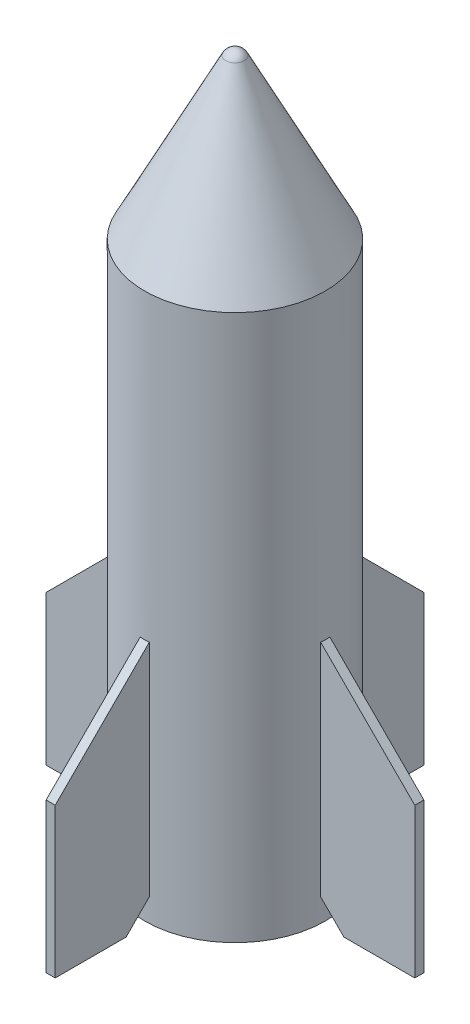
ISO-10303-21;
HEADER;
FILE_DESCRIPTION(('STEP AP214'),'2;1');
FILE_NAME('part.step','',(''),(''),'','','');
FILE_SCHEMA(('AUTOMOTIVE_DESIGN { 1 0 10303 214 1 1 1 1 }'));
ENDSEC;
DATA;
#1=APPLICATION_CONTEXT('core data for automotive mechanical design processes');
#2=APPLICATION_PROTOCOL_DEFINITION('international standard','automotive_design',2000,#1);
#3=PRODUCT_CONTEXT('',#1,'mechanical');
#4=PRODUCT('Part','Part','',(#3));
#5=PRODUCT_RELATED_PRODUCT_CATEGORY('part','',(#4));
#6=PRODUCT_DEFINITION_FORMATION('','',#4);
#7=PRODUCT_DEFINITION_CONTEXT('part definition',#1,'design');
#8=PRODUCT_DEFINITION('design','',#6,#7);
#9=PRODUCT_DEFINITION_SHAPE('','',#8);
#10=(LENGTH_UNIT() NAMED_UNIT(*) SI_UNIT(.MILLI.,.METRE.));
#11=(NAMED_UNIT(*) PLANE_ANGLE_UNIT() SI_UNIT($,.RADIAN.));
#12=(NAMED_UNIT(*) SI_UNIT($,.STERADIAN.) SOLID_ANGLE_UNIT());
#13=UNCERTAINTY_MEASURE_WITH_UNIT(LENGTH_MEASURE(1.E-05),#10,'distance_accuracy_value','');
#14=(GEOMETRIC_REPRESENTATION_CONTEXT(3) GLOBAL_UNCERTAINTY_ASSIGNED_CONTEXT((#13)) GLOBAL_UNIT_ASSIGNED_CONTEXT((#10,
#11,#12)) REPRESENTATION_CONTEXT('',''));
#15=CARTESIAN_POINT('',(0.,0.,0.));
#16=DIRECTION('',(0.,0.,1.));
#17=DIRECTION('',(1.,0.,0.));
#18=AXIS2_PLACEMENT_3D('',#15,#16,#17);
#19=CARTESIAN_POINT('',(0.,300.,0.));
#20=DIRECTION('',(0.,-1.,0.));
#21=DIRECTION('',(0.,0.,-1.));
#22=AXIS2_PLACEMENT_3D('',#19,#20,#21);
#23=CYLINDRICAL_SURFACE('',#22,49.673);
#24=CARTESIAN_POINT('',(0.,183.613789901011,0.));
#25=DIRECTION('',(0.,-0.707106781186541,0.707106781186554));
#26=DIRECTION('',(0.,-0.707106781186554,-0.707106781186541));
#27=AXIS2_PLACEMENT_3D('',#24,#25,#26);
#28=ELLIPSE('',#27,70.2482302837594,49.673);
#29=CARTESIAN_POINT('',(-2.50000000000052,134.003741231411,-49.6100486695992));
#30=VERTEX_POINT('',#29);
#31=CARTESIAN_POINT('',(2.49999999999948,134.003741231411,-49.6100486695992));
#32=VERTEX_POINT('',#31);
#33=EDGE_CURVE('E40',#30,#32,#28,.T.);
#34=ORIENTED_EDGE('',*,*,#33,.F.);
#35=DIRECTION('',(0.,-1.,0.));
#36=VECTOR('',#35,1.);
#37=CARTESIAN_POINT('',(-2.50000000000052,300.,-49.6100486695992));
#38=LINE('',#37,#36);
#39=CARTESIAN_POINT('',(-2.50000000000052,12.7640363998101,-49.6100486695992));
#40=VERTEX_POINT('',#39);
#41=EDGE_CURVE('E11',#30,#40,#38,.T.);
#42=ORIENTED_EDGE('',*,*,#41,.T.);
#43=CARTESIAN_POINT('',(0.,62.3740850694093,0.));
#44=DIRECTION('',(0.,0.707106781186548,-0.707106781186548));
#45=DIRECTION('',(0.,-0.707106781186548,-0.707106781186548));
#46=AXIS2_PLACEMENT_3D('',#43,#44,#45);
#47=ELLIPSE('',#46,70.2482302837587,49.673);
#48=CARTESIAN_POINT('',(2.49999999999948,12.7640363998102,-49.6100486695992));
#49=VERTEX_POINT('',#48);
#50=EDGE_CURVE('E328',#49,#40,#47,.T.);
#51=ORIENTED_EDGE('',*,*,#50,.F.);
#52=DIRECTION('',(0.,-1.,0.));
#53=VECTOR('',#52,1.);
#54=CARTESIAN_POINT('',(2.49999999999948,300.,-49.6100486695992));
#55=LINE('',#54,#53);
#56=EDGE_CURVE('E325',#32,#49,#55,.T.);
#57=ORIENTED_EDGE('',*,*,#56,.F.);
#58=EDGE_LOOP('',(#34,#42,#51,#57));
#59=FACE_BOUND('',#58,.T.);
#60=CARTESIAN_POINT('',(0.,183.613789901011,0.));
#61=DIRECTION('',(-0.707106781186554,-0.707106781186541,0.));
#62=DIRECTION('',(0.707106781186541,-0.707106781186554,0.));
#63=AXIS2_PLACEMENT_3D('',#60,#61,#62);
#64=ELLIPSE('',#63,70.2482302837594,49.673);
#65=CARTESIAN_POINT('',(49.6100486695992,134.003741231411,-2.5));
#66=VERTEX_POINT('',#65);
#67=CARTESIAN_POINT('',(49.6100486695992,134.003741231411,2.5));
#68=VERTEX_POINT('',#67);
#69=EDGE_CURVE('E320',#66,#68,#64,.T.);
#70=ORIENTED_EDGE('',*,*,#69,.F.);
#71=DIRECTION('',(0.,-1.,0.));
#72=VECTOR('',#71,1.);
#73=CARTESIAN_POINT('',(49.6100486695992,300.,-2.5));
#74=LINE('',#73,#72);
#75=CARTESIAN_POINT('',(49.6100486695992,12.7640363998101,-2.5));
#76=VERTEX_POINT('',#75);
#77=EDGE_CURVE('E323',#66,#76,#74,.T.);
#78=ORIENTED_EDGE('',*,*,#77,.T.);
#79=CARTESIAN_POINT('',(0.,62.3740850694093,0.));
#80=DIRECTION('',(0.707106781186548,0.707106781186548,0.));
#81=DIRECTION('',(0.707106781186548,-0.707106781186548,0.));
#82=AXIS2_PLACEMENT_3D('',#79,#80,#81);
#83=ELLIPSE('',#82,70.2482302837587,49.673);
#84=CARTESIAN_POINT('',(49.6100486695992,12.7640363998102,2.5));
#85=VERTEX_POINT('',#84);
#86=EDGE_CURVE('E317',#85,#76,#83,.T.);
#87=ORIENTED_EDGE('',*,*,#86,.F.);
#88=DIRECTION('',(0.,-1.,0.));
#89=VECTOR('',#88,1.);
#90=CARTESIAN_POINT('',(49.6100486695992,300.,2.5));
#91=LINE('',#90,#89);
#92=EDGE_CURVE('E314',#68,#85,#91,.T.);
#93=ORIENTED_EDGE('',*,*,#92,.F.);
#94=EDGE_LOOP('',(#70,#78,#87,#93));
#95=FACE_BOUND('',#94,.T.);
#96=CARTESIAN_POINT('',(0.,183.613789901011,0.));
#97=DIRECTION('',(0.,-0.707106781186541,-0.707106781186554));
#98=DIRECTION('',(0.,-0.707106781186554,0.707106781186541));
#99=AXIS2_PLACEMENT_3D('',#96,#97,#98);
#100=ELLIPSE('',#99,70.2482302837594,49.673);
#101=CARTESIAN_POINT('',(2.50000000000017,134.003741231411,49.6100486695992));
#102=VERTEX_POINT('',#101);
#103=CARTESIAN_POINT('',(-2.49999999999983,134.003741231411,49.6100486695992));
#104=VERTEX_POINT('',#103);
#105=EDGE_CURVE('E309',#102,#104,#100,.T.);
#106=ORIENTED_EDGE('',*,*,#105,.F.);
#107=DIRECTION('',(0.,-1.,0.));
#108=VECTOR('',#107,1.);
#109=CARTESIAN_POINT('',(2.50000000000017,300.,49.6100486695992));
#110=LINE('',#109,#108);
#111=CARTESIAN_POINT('',(2.50000000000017,12.7640363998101,49.6100486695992));
#112=VERTEX_POINT('',#111);
#113=EDGE_CURVE('E312',#102,#112,#110,.T.);
#114=ORIENTED_EDGE('',*,*,#113,.T.);
#115=CARTESIAN_POINT('',(0.,62.3740850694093,0.));
#116=DIRECTION('',(0.,0.707106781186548,0.707106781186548));
#117=DIRECTION('',(0.,-0.707106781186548,0.707106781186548));
#118=AXIS2_PLACEMENT_3D('',#115,#116,#117);
#119=ELLIPSE('',#118,70.2482302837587,49.673);
#120=CARTESIAN_POINT('',(-2.49999999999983,12.7640363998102,49.6100486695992));
#121=VERTEX_POINT('',#120);
#122=EDGE_CURVE('E306',#121,#112,#119,.T.);
#123=ORIENTED_EDGE('',*,*,#122,.F.);
#124=DIRECTION('',(0.,-1.,0.));
#125=VECTOR('',#124,1.);
#126=CARTESIAN_POINT('',(-2.49999999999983,300.,49.6100486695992));
#127=LINE('',#126,#125);
#128=EDGE_CURVE('E303',#104,#121,#127,.T.);
#129=ORIENTED_EDGE('',*,*,#128,.F.);
#130=EDGE_LOOP('',(#106,#114,#123,#129));
#131=FACE_BOUND('',#130,.T.);
#132=CARTESIAN_POINT('',(0.,183.613789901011,0.));
#133=DIRECTION('',(0.707106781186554,-0.707106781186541,0.));
#134=DIRECTION('',(-0.707106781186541,-0.707106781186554,0.));
#135=AXIS2_PLACEMENT_3D('',#132,#133,#134);
#136=ELLIPSE('',#135,70.2482302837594,49.673);
#137=CARTESIAN_POINT('',(-49.6100486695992,134.003741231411,2.5));
#138=VERTEX_POINT('',#137);
#139=CARTESIAN_POINT('',(-49.6100486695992,134.003741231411,-2.5));
#140=VERTEX_POINT('',#139);
#141=EDGE_CURVE('E298',#138,#140,#136,.T.);
#142=ORIENTED_EDGE('',*,*,#141,.F.);
#143=DIRECTION('',(0.,-1.,0.));
#144=VECTOR('',#143,1.);
#145=CARTESIAN_POINT('',(-49.6100486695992,300.,2.5));
#146=LINE('',#145,#144);
#147=CARTESIAN_POINT('',(-49.6100486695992,12.7640363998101,2.5));
#148=VERTEX_POINT('',#147);
#149=EDGE_CURVE('E301',#138,#148,#146,.T.);
#150=ORIENTED_EDGE('',*,*,#149,.T.);
#151=CARTESIAN_POINT('',(0.,62.3740850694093,0.));
#152=DIRECTION('',(-0.707106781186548,0.707106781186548,0.));
#153=DIRECTION('',(-0.707106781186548,-0.707106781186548,0.));
#154=AXIS2_PLACEMENT_3D('',#151,#152,#153);
#155=ELLIPSE('',#154,70.2482302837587,49.673);
#156=CARTESIAN_POINT('',(-49.6100486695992,12.7640363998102,-2.5));
#157=VERTEX_POINT('',#156);
#158=EDGE_CURVE('E295',#157,#148,#155,.T.);
#159=ORIENTED_EDGE('',*,*,#158,.F.);
#160=DIRECTION('',(0.,-1.,0.));
#161=VECTOR('',#160,1.);
#162=CARTESIAN_POINT('',(-49.6100486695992,300.,-2.5));
#163=LINE('',#162,#161);
#164=EDGE_CURVE('E290',#140,#157,#163,.T.);
#165=ORIENTED_EDGE('',*,*,#164,.F.);
#166=EDGE_LOOP('',(#142,#150,#159,#165));
#167=FACE_BOUND('',#166,.T.);
#168=CARTESIAN_POINT('',(0.,300.,0.));
#169=DIRECTION('',(0.,1.,0.));
#170=DIRECTION('',(0.,0.,1.));
#171=AXIS2_PLACEMENT_3D('',#168,#169,#170);
#172=CIRCLE('',#171,49.673);
#173=CARTESIAN_POINT('',(0.,300.,-49.673));
#174=VERTEX_POINT('',#173);
#175=EDGE_CURVE('E287',#174,#174,#172,.T.);
#176=ORIENTED_EDGE('',*,*,#175,.F.);
#177=EDGE_LOOP('',(#176));
#178=FACE_BOUND('',#177,.T.);
#179=CARTESIAN_POINT('',(0.,0.,0.));
#180=DIRECTION('',(0.,1.,0.));
#181=DIRECTION('',(0.,0.,1.));
#182=AXIS2_PLACEMENT_3D('',#179,#180,#181);
#183=CIRCLE('',#182,49.673);
#184=CARTESIAN_POINT('',(0.,0.,49.673));
#185=VERTEX_POINT('',#184);
#186=EDGE_CURVE('E286',#185,#185,#183,.T.);
#187=ORIENTED_EDGE('',*,*,#186,.T.);
#188=EDGE_LOOP('',(#187));
#189=FACE_BOUND('',#188,.T.);
#190=ADVANCED_FACE('F33',(#59,#95,#131,#167,#178,#189),#23,.T.);
#191=CARTESIAN_POINT('',(0.,0.,0.));
#192=DIRECTION('',(0.,1.,0.));
#193=DIRECTION('',(0.,0.,1.));
#194=AXIS2_PLACEMENT_3D('',#191,#192,#193);
#195=PLANE('',#194);
#196=ORIENTED_EDGE('',*,*,#186,.F.);
#197=EDGE_LOOP('',(#196));
#198=FACE_BOUND('',#197,.T.);
#199=ADVANCED_FACE('F341',(#198),#195,.F.);
#200=CARTESIAN_POINT('',(0.,384.801,0.));
#201=DIRECTION('',(0.,-1.,0.));
#202=DIRECTION('',(-1.,0.,0.));
#203=AXIS2_PLACEMENT_3D('',#200,#201,#202);
#204=SPHERICAL_SURFACE('',#203,5.76000000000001);
#205=CARTESIAN_POINT('',(0.,387.415991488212,0.));
#206=DIRECTION('',(0.,-1.,0.));
#207=DIRECTION('',(0.,0.,-1.));
#208=AXIS2_PLACEMENT_3D('',#205,#206,#207);
#209=CIRCLE('',#208,5.13219441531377);
#210=CARTESIAN_POINT('',(0.,387.415991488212,-5.13219441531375));
#211=VERTEX_POINT('',#210);
#212=EDGE_CURVE('E283',#211,#211,#209,.T.);
#213=ORIENTED_EDGE('',*,*,#212,.F.);
#214=EDGE_LOOP('',(#213));
#215=FACE_BOUND('',#214,.T.);
#216=ADVANCED_FACE('F353',(#215),#204,.T.);
#217=CARTESIAN_POINT('',(0.,387.415991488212,0.));
#218=DIRECTION('',(0.,-1.,0.));
#219=DIRECTION('',(0.,0.,-1.));
#220=AXIS2_PLACEMENT_3D('',#217,#218,#219);
#221=CONICAL_SURFACE('',#220,5.13219441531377,0.471240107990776);
#222=CARTESIAN_POINT('',(0.,300.,-49.673));
#223=CARTESIAN_POINT('',(0.,300.910583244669,-49.2090332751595));
#224=CARTESIAN_POINT('',(0.,301.821166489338,-48.7450665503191));
#225=CARTESIAN_POINT('',(0.,303.642332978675,-47.8171331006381));
#226=CARTESIAN_POINT('',(0.,304.552916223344,-47.3531663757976));
#227=CARTESIAN_POINT('',(0.,306.374082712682,-46.4252329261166));
#228=CARTESIAN_POINT('',(0.,307.284665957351,-45.9612662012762));
#229=CARTESIAN_POINT('',(0.,309.105832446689,-45.0333327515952));
#230=CARTESIAN_POINT('',(0.,310.016415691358,-44.5693660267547));
#231=CARTESIAN_POINT('',(0.,311.837582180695,-43.6414325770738));
#232=CARTESIAN_POINT('',(0.,312.748165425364,-43.1774658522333));
#233=CARTESIAN_POINT('',(0.,314.569331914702,-42.2495324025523));
#234=CARTESIAN_POINT('',(0.,315.479915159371,-41.7855656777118));
#235=CARTESIAN_POINT('',(0.,317.301081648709,-40.8576322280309));
#236=CARTESIAN_POINT('',(0.,318.211664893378,-40.3936655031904));
#237=CARTESIAN_POINT('',(0.,320.032831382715,-39.4657320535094));
#238=CARTESIAN_POINT('',(0.,320.943414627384,-39.0017653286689));
#239=CARTESIAN_POINT('',(0.,322.764581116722,-38.073831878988));
#240=CARTESIAN_POINT('',(0.,323.675164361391,-37.6098651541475));
#241=CARTESIAN_POINT('',(0.,325.496330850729,-36.6819317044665));
#242=CARTESIAN_POINT('',(0.,326.406914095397,-36.217964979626));
#243=CARTESIAN_POINT('',(0.,328.228080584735,-35.2900315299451));
#244=CARTESIAN_POINT('',(0.,329.138663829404,-34.8260648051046));
#245=CARTESIAN_POINT('',(0.,330.959830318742,-33.8981313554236));
#246=CARTESIAN_POINT('',(0.,331.870413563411,-33.4341646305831));
#247=CARTESIAN_POINT('',(0.,333.691580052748,-32.5062311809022));
#248=CARTESIAN_POINT('',(0.,334.602163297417,-32.0422644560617));
#249=CARTESIAN_POINT('',(0.,336.423329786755,-31.1143310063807));
#250=CARTESIAN_POINT('',(0.,337.333913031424,-30.6503642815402));
#251=CARTESIAN_POINT('',(0.,339.155079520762,-29.7224308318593));
#252=CARTESIAN_POINT('',(0.,340.065662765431,-29.2584641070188));
#253=CARTESIAN_POINT('',(0.,341.886829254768,-28.3305306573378));
#254=CARTESIAN_POINT('',(0.,342.797412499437,-27.8665639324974));
#255=CARTESIAN_POINT('',(0.,344.618578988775,-26.9386304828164));
#256=CARTESIAN_POINT('',(0.,345.529162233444,-26.4746637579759));
#257=CARTESIAN_POINT('',(0.,347.350328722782,-25.546730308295));
#258=CARTESIAN_POINT('',(0.,348.260911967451,-25.0827635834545));
#259=CARTESIAN_POINT('',(0.,350.082078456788,-24.1548301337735));
#260=CARTESIAN_POINT('',(0.,350.992661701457,-23.690863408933));
#261=CARTESIAN_POINT('',(0.,352.813828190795,-22.7629299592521));
#262=CARTESIAN_POINT('',(0.,353.724411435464,-22.2989632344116));
#263=CARTESIAN_POINT('',(0.,355.545577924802,-21.3710297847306));
#264=CARTESIAN_POINT('',(0.,356.45616116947,-20.9070630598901));
#265=CARTESIAN_POINT('',(0.,358.277327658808,-19.9791296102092));
#266=CARTESIAN_POINT('',(0.,359.187910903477,-19.5151628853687));
#267=CARTESIAN_POINT('',(0.,361.009077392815,-18.5872294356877));
#268=CARTESIAN_POINT('',(0.,361.919660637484,-18.1232627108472));
#269=CARTESIAN_POINT('',(0.,363.740827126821,-17.1953292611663));
#270=CARTESIAN_POINT('',(0.,364.65141037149,-16.7313625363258));
#271=CARTESIAN_POINT('',(0.,366.472576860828,-15.8034290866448));
#272=CARTESIAN_POINT('',(0.,367.383160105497,-15.3394623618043));
#273=CARTESIAN_POINT('',(0.,369.204326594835,-14.4115289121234));
#274=CARTESIAN_POINT('',(0.,370.114909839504,-13.9475621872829));
#275=CARTESIAN_POINT('',(0.,371.936076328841,-13.0196287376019));
#276=CARTESIAN_POINT('',(0.,372.84665957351,-12.5556620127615));
#277=CARTESIAN_POINT('',(0.,374.667826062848,-11.6277285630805));
#278=CARTESIAN_POINT('',(0.,375.578409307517,-11.16376183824));
#279=CARTESIAN_POINT('',(0.,377.399575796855,-10.235828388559));
#280=CARTESIAN_POINT('',(0.,378.310159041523,-9.77186166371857));
#281=CARTESIAN_POINT('',(0.,380.131325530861,-8.84392821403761));
#282=CARTESIAN_POINT('',(0.,381.04190877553,-8.37996148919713));
#283=CARTESIAN_POINT('',(0.,382.863075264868,-7.45202803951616));
#284=CARTESIAN_POINT('',(0.,383.773658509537,-6.98806131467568));
#285=CARTESIAN_POINT('',(0.,385.594824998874,-6.06012786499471));
#286=CARTESIAN_POINT('',(0.,386.505408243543,-5.59616114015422));
#287=CARTESIAN_POINT('',(0.,387.415991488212,-5.13219441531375));
#288=B_SPLINE_CURVE_WITH_KNOTS('',3,(#222,#223,#224,#225,#226,#227,#228,#229,#230,#231,#232,
#233,#234,#235,#236,#237,#238,#239,#240,#241,#242,#243,#244,#245,#246,#247,#248,#249,#250,#251,
#252,#253,#254,#255,#256,#257,#258,#259,#260,#261,#262,#263,#264,#265,#266,#267,#268,#269,#270,
#271,#272,#273,#274,#275,#276,#277,#278,#279,#280,#281,#282,#283,#284,#285,#286,#287),
.UNSPECIFIED.,.F.,.F.,(4,2,2,2,2,2,2,2,2,2,2,2,2,2,2,2,2,2,2,2,2,2,2,2,2,2,2,2,2,2,2,2,4),(0.,
3.0659162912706,6.1318325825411,9.19774887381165,12.2636651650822,15.3295814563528,
18.3954977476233,21.4614140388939,24.5273303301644,27.5932466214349,30.6591629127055,
33.725079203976,36.7909954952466,39.8569117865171,42.9228280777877,45.9887443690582,
49.0546606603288,52.1205769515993,55.1864932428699,58.2524095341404,61.318325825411,
64.3842421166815,67.450158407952,70.5160746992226,73.5819909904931,76.6479072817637,
79.7138235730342,82.7797398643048,85.8456561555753,88.9115724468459,91.9774887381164,
95.0434050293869,98.1093213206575),.UNSPECIFIED.);
#289=EDGE_CURVE('BSEAM357',#174,#211,#288,.T.);
#290=ORIENTED_EDGE('',*,*,#175,.T.);
#291=ORIENTED_EDGE('',*,*,#212,.T.);
#292=ORIENTED_EDGE('',*,*,#289,.T.);
#293=ORIENTED_EDGE('',*,*,#289,.F.);
#294=EDGE_LOOP('',(#290,#292,#291,#293));
#295=FACE_BOUND('',#294,.T.);
#296=ADVANCED_FACE('F357',(#295),#221,.T.);
#297=CARTESIAN_POINT('',(-43.2498911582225,140.363898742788,2.5));
#298=DIRECTION('',(0.707106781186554,-0.707106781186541,0.));
#299=DIRECTION('',(0.707106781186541,0.707106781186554,0.));
#300=AXIS2_PLACEMENT_3D('',#297,#298,#299);
#301=PLANE('',#300);
#302=DIRECTION('',(-0.707106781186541,-0.707106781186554,0.));
#303=VECTOR('',#302,1.);
#304=CARTESIAN_POINT('',(-43.2498911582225,140.363898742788,2.5));
#305=LINE('',#304,#303);
#306=CARTESIAN_POINT('',(-101.341288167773,82.2725017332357,2.5));
#307=VERTEX_POINT('',#306);
#308=EDGE_CURVE('E257',#138,#307,#305,.T.);
#309=ORIENTED_EDGE('',*,*,#308,.F.);
#310=ORIENTED_EDGE('',*,*,#141,.T.);
#311=DIRECTION('',(-0.707106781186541,-0.707106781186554,0.));
#312=VECTOR('',#311,1.);
#313=CARTESIAN_POINT('',(-43.2498911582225,140.363898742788,-2.5));
#314=LINE('',#313,#312);
#315=CARTESIAN_POINT('',(-101.341288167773,82.2725017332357,-2.5));
#316=VERTEX_POINT('',#315);
#317=EDGE_CURVE('E256',#140,#316,#314,.T.);
#318=ORIENTED_EDGE('',*,*,#317,.T.);
#319=DIRECTION('',(0.,0.,-1.));
#320=VECTOR('',#319,1.);
#321=CARTESIAN_POINT('',(-101.341288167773,82.2725017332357,2.5));
#322=LINE('',#321,#320);
#323=EDGE_CURVE('E280',#307,#316,#322,.T.);
#324=ORIENTED_EDGE('',*,*,#323,.F.);
#325=EDGE_LOOP('',(#309,#310,#318,#324));
#326=FACE_BOUND('',#325,.T.);
#327=ADVANCED_FACE('F363',(#326),#301,.F.);
#328=CARTESIAN_POINT('',(-62.3740850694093,0.,2.5));
#329=DIRECTION('',(-0.707106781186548,0.707106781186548,0.));
#330=DIRECTION('',(-0.707106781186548,-0.707106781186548,0.));
#331=AXIS2_PLACEMENT_3D('',#328,#329,#330);
#332=PLANE('',#331);
#333=DIRECTION('',(0.707106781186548,0.707106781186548,0.));
#334=VECTOR('',#333,1.);
#335=CARTESIAN_POINT('',(-62.3740850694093,0.,-2.5));
#336=LINE('',#335,#334);
#337=CARTESIAN_POINT('',(-62.3740850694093,0.,-2.5));
#338=VERTEX_POINT('',#337);
#339=EDGE_CURVE('E260',#338,#157,#336,.T.);
#340=ORIENTED_EDGE('',*,*,#339,.T.);
#341=ORIENTED_EDGE('',*,*,#158,.T.);
#342=DIRECTION('',(0.707106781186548,0.707106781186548,0.));
#343=VECTOR('',#342,1.);
#344=CARTESIAN_POINT('',(-62.3740850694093,0.,2.5));
#345=LINE('',#344,#343);
#346=CARTESIAN_POINT('',(-62.3740850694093,0.,2.5));
#347=VERTEX_POINT('',#346);
#348=EDGE_CURVE('E264',#347,#148,#345,.T.);
#349=ORIENTED_EDGE('',*,*,#348,.F.);
#350=DIRECTION('',(0.,0.,-1.));
#351=VECTOR('',#350,1.);
#352=CARTESIAN_POINT('',(-62.3740850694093,0.,2.5));
#353=LINE('',#352,#351);
#354=EDGE_CURVE('E267',#347,#338,#353,.T.);
#355=ORIENTED_EDGE('',*,*,#354,.T.);
#356=EDGE_LOOP('',(#340,#341,#349,#355));
#357=FACE_BOUND('',#356,.T.);
#358=ADVANCED_FACE('F367',(#357),#332,.F.);
#359=CARTESIAN_POINT('',(-43.2498911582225,0.,2.5));
#360=DIRECTION('',(0.,0.,1.));
#361=DIRECTION('',(1.,0.,0.));
#362=AXIS2_PLACEMENT_3D('',#359,#360,#361);
#363=PLANE('',#362);
#364=ORIENTED_EDGE('',*,*,#149,.F.);
#365=ORIENTED_EDGE('',*,*,#308,.T.);
#366=DIRECTION('',(0.,-1.,0.));
#367=VECTOR('',#366,1.);
#368=CARTESIAN_POINT('',(-101.341288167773,82.2725017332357,2.5));
#369=LINE('',#368,#367);
#370=CARTESIAN_POINT('',(-101.341288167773,0.,2.5));
#371=VERTEX_POINT('',#370);
#372=EDGE_CURVE('E259',#307,#371,#369,.T.);
#373=ORIENTED_EDGE('',*,*,#372,.T.);
#374=DIRECTION('',(1.,0.,0.));
#375=VECTOR('',#374,1.);
#376=CARTESIAN_POINT('',(-101.341288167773,0.,2.5));
#377=LINE('',#376,#375);
#378=EDGE_CURVE('E262',#371,#347,#377,.T.);
#379=ORIENTED_EDGE('',*,*,#378,.T.);
#380=ORIENTED_EDGE('',*,*,#348,.T.);
#381=EDGE_LOOP('',(#364,#365,#373,#379,#380));
#382=FACE_BOUND('',#381,.T.);
#383=ADVANCED_FACE('F381',(#382),#363,.T.);
#384=CARTESIAN_POINT('',(-43.2498911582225,0.,-2.5));
#385=DIRECTION('',(0.,0.,1.));
#386=DIRECTION('',(1.,0.,0.));
#387=AXIS2_PLACEMENT_3D('',#384,#385,#386);
#388=PLANE('',#387);
#389=ORIENTED_EDGE('',*,*,#317,.F.);
#390=ORIENTED_EDGE('',*,*,#164,.T.);
#391=ORIENTED_EDGE('',*,*,#339,.F.);
#392=DIRECTION('',(1.,0.,0.));
#393=VECTOR('',#392,1.);
#394=CARTESIAN_POINT('',(-101.341288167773,0.,-2.5));
#395=LINE('',#394,#393);
#396=CARTESIAN_POINT('',(-101.341288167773,0.,-2.5));
#397=VERTEX_POINT('',#396);
#398=EDGE_CURVE('E271',#397,#338,#395,.T.);
#399=ORIENTED_EDGE('',*,*,#398,.F.);
#400=DIRECTION('',(0.,-1.,0.));
#401=VECTOR('',#400,1.);
#402=CARTESIAN_POINT('',(-101.341288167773,82.2725017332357,-2.5));
#403=LINE('',#402,#401);
#404=EDGE_CURVE('E269',#316,#397,#403,.T.);
#405=ORIENTED_EDGE('',*,*,#404,.F.);
#406=EDGE_LOOP('',(#389,#390,#391,#399,#405));
#407=FACE_BOUND('',#406,.T.);
#408=ADVANCED_FACE('F373',(#407),#388,.F.);
#409=CARTESIAN_POINT('',(-101.341288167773,82.2725017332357,2.5));
#410=DIRECTION('',(1.,0.,0.));
#411=DIRECTION('',(0.,1.,0.));
#412=AXIS2_PLACEMENT_3D('',#409,#410,#411);
#413=PLANE('',#412);
#414=ORIENTED_EDGE('',*,*,#404,.T.);
#415=DIRECTION('',(0.,0.,-1.));
#416=VECTOR('',#415,1.);
#417=CARTESIAN_POINT('',(-101.341288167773,0.,2.5));
#418=LINE('',#417,#416);
#419=EDGE_CURVE('E277',#371,#397,#418,.T.);
#420=ORIENTED_EDGE('',*,*,#419,.F.);
#421=ORIENTED_EDGE('',*,*,#372,.F.);
#422=ORIENTED_EDGE('',*,*,#323,.T.);
#423=EDGE_LOOP('',(#414,#420,#421,#422));
#424=FACE_BOUND('',#423,.T.);
#425=ADVANCED_FACE('F369',(#424),#413,.F.);
#426=CARTESIAN_POINT('',(-101.341288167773,0.,2.5));
#427=DIRECTION('',(0.,1.,0.));
#428=DIRECTION('',(0.,0.,1.));
#429=AXIS2_PLACEMENT_3D('',#426,#427,#428);
#430=PLANE('',#429);
#431=ORIENTED_EDGE('',*,*,#398,.T.);
#432=ORIENTED_EDGE('',*,*,#354,.F.);
#433=ORIENTED_EDGE('',*,*,#378,.F.);
#434=ORIENTED_EDGE('',*,*,#419,.T.);
#435=EDGE_LOOP('',(#431,#432,#433,#434));
#436=FACE_BOUND('',#435,.T.);
#437=ADVANCED_FACE('F372',(#436),#430,.F.);
#438=CARTESIAN_POINT('',(2.50000000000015,140.363898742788,43.2498911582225));
#439=DIRECTION('',(0.,-0.707106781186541,-0.707106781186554));
#440=DIRECTION('',(0.,0.707106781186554,-0.707106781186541));
#441=AXIS2_PLACEMENT_3D('',#438,#439,#440);
#442=PLANE('',#441);
#443=DIRECTION('',(0.,-0.707106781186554,0.707106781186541));
#444=VECTOR('',#443,1.);
#445=CARTESIAN_POINT('',(2.50000000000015,140.363898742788,43.2498911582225));
#446=LINE('',#445,#444);
#447=CARTESIAN_POINT('',(2.50000000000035,82.2725017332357,101.341288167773));
#448=VERTEX_POINT('',#447);
#449=EDGE_CURVE('E230',#102,#448,#446,.T.);
#450=ORIENTED_EDGE('',*,*,#449,.F.);
#451=ORIENTED_EDGE('',*,*,#105,.T.);
#452=DIRECTION('',(0.,-0.707106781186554,0.707106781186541));
#453=VECTOR('',#452,1.);
#454=CARTESIAN_POINT('',(-2.49999999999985,140.363898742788,43.2498911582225));
#455=LINE('',#454,#453);
#456=CARTESIAN_POINT('',(-2.49999999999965,82.2725017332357,101.341288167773));
#457=VERTEX_POINT('',#456);
#458=EDGE_CURVE('E229',#104,#457,#455,.T.);
#459=ORIENTED_EDGE('',*,*,#458,.T.);
#460=DIRECTION('',(-1.,0.,0.));
#461=VECTOR('',#460,1.);
#462=CARTESIAN_POINT('',(2.50000000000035,82.2725017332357,101.341288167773));
#463=LINE('',#462,#461);
#464=EDGE_CURVE('E253',#448,#457,#463,.T.);
#465=ORIENTED_EDGE('',*,*,#464,.F.);
#466=EDGE_LOOP('',(#450,#451,#459,#465));
#467=FACE_BOUND('',#466,.T.);
#468=ADVANCED_FACE('F377',(#467),#442,.F.);
#469=CARTESIAN_POINT('',(2.50000000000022,0.,62.3740850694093));
#470=DIRECTION('',(0.,0.707106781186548,0.707106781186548));
#471=DIRECTION('',(0.,-0.707106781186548,0.707106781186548));
#472=AXIS2_PLACEMENT_3D('',#469,#470,#471);
#473=PLANE('',#472);
#474=DIRECTION('',(0.,0.707106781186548,-0.707106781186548));
#475=VECTOR('',#474,1.);
#476=CARTESIAN_POINT('',(-2.49999999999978,0.,62.3740850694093));
#477=LINE('',#476,#475);
#478=CARTESIAN_POINT('',(-2.49999999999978,0.,62.3740850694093));
#479=VERTEX_POINT('',#478);
#480=EDGE_CURVE('E233',#479,#121,#477,.T.);
#481=ORIENTED_EDGE('',*,*,#480,.T.);
#482=ORIENTED_EDGE('',*,*,#122,.T.);
#483=DIRECTION('',(0.,0.707106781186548,-0.707106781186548));
#484=VECTOR('',#483,1.);
#485=CARTESIAN_POINT('',(2.50000000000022,0.,62.3740850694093));
#486=LINE('',#485,#484);
#487=CARTESIAN_POINT('',(2.50000000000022,0.,62.3740850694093));
#488=VERTEX_POINT('',#487);
#489=EDGE_CURVE('E237',#488,#112,#486,.T.);
#490=ORIENTED_EDGE('',*,*,#489,.F.);
#491=DIRECTION('',(-1.,0.,0.));
#492=VECTOR('',#491,1.);
#493=CARTESIAN_POINT('',(2.50000000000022,0.,62.3740850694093));
#494=LINE('',#493,#492);
#495=EDGE_CURVE('E240',#488,#479,#494,.T.);
#496=ORIENTED_EDGE('',*,*,#495,.T.);
#497=EDGE_LOOP('',(#481,#482,#490,#496));
#498=FACE_BOUND('',#497,.T.);
#499=ADVANCED_FACE('F391',(#498),#473,.F.);
#500=CARTESIAN_POINT('',(2.50000000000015,0.,43.2498911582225));
#501=DIRECTION('',(1.,0.,0.));
#502=DIRECTION('',(0.,0.,-1.));
#503=AXIS2_PLACEMENT_3D('',#500,#501,#502);
#504=PLANE('',#503);
#505=ORIENTED_EDGE('',*,*,#113,.F.);
#506=ORIENTED_EDGE('',*,*,#449,.T.);
#507=DIRECTION('',(0.,-1.,0.));
#508=VECTOR('',#507,1.);
#509=CARTESIAN_POINT('',(2.50000000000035,82.2725017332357,101.341288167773));
#510=LINE('',#509,#508);
#511=CARTESIAN_POINT('',(2.50000000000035,0.,101.341288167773));
#512=VERTEX_POINT('',#511);
#513=EDGE_CURVE('E232',#448,#512,#510,.T.);
#514=ORIENTED_EDGE('',*,*,#513,.T.);
#515=DIRECTION('',(0.,0.,-1.));
#516=VECTOR('',#515,1.);
#517=CARTESIAN_POINT('',(2.50000000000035,0.,101.341288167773));
#518=LINE('',#517,#516);
#519=EDGE_CURVE('E235',#512,#488,#518,.T.);
#520=ORIENTED_EDGE('',*,*,#519,.T.);
#521=ORIENTED_EDGE('',*,*,#489,.T.);
#522=EDGE_LOOP('',(#505,#506,#514,#520,#521));
#523=FACE_BOUND('',#522,.T.);
#524=ADVANCED_FACE('F405',(#523),#504,.T.);
#525=CARTESIAN_POINT('',(-2.49999999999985,0.,43.2498911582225));
#526=DIRECTION('',(1.,0.,0.));
#527=DIRECTION('',(0.,0.,-1.));
#528=AXIS2_PLACEMENT_3D('',#525,#526,#527);
#529=PLANE('',#528);
#530=ORIENTED_EDGE('',*,*,#458,.F.);
#531=ORIENTED_EDGE('',*,*,#128,.T.);
#532=ORIENTED_EDGE('',*,*,#480,.F.);
#533=DIRECTION('',(0.,0.,-1.));
#534=VECTOR('',#533,1.);
#535=CARTESIAN_POINT('',(-2.49999999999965,0.,101.341288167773));
#536=LINE('',#535,#534);
#537=CARTESIAN_POINT('',(-2.49999999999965,0.,101.341288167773));
#538=VERTEX_POINT('',#537);
#539=EDGE_CURVE('E244',#538,#479,#536,.T.);
#540=ORIENTED_EDGE('',*,*,#539,.F.);
#541=DIRECTION('',(0.,-1.,0.));
#542=VECTOR('',#541,1.);
#543=CARTESIAN_POINT('',(-2.49999999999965,82.2725017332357,101.341288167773));
#544=LINE('',#543,#542);
#545=EDGE_CURVE('E242',#457,#538,#544,.T.);
#546=ORIENTED_EDGE('',*,*,#545,.F.);
#547=EDGE_LOOP('',(#530,#531,#532,#540,#546));
#548=FACE_BOUND('',#547,.T.);
#549=ADVANCED_FACE('F397',(#548),#529,.F.);
#550=CARTESIAN_POINT('',(2.50000000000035,82.2725017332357,101.341288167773));
#551=DIRECTION('',(0.,0.,-1.));
#552=DIRECTION('',(-1.,0.,0.));
#553=AXIS2_PLACEMENT_3D('',#550,#551,#552);
#554=PLANE('',#553);
#555=ORIENTED_EDGE('',*,*,#545,.T.);
#556=DIRECTION('',(-1.,0.,0.));
#557=VECTOR('',#556,1.);
#558=CARTESIAN_POINT('',(2.50000000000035,0.,101.341288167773));
#559=LINE('',#558,#557);
#560=EDGE_CURVE('E250',#512,#538,#559,.T.);
#561=ORIENTED_EDGE('',*,*,#560,.F.);
#562=ORIENTED_EDGE('',*,*,#513,.F.);
#563=ORIENTED_EDGE('',*,*,#464,.T.);
#564=EDGE_LOOP('',(#555,#561,#562,#563));
#565=FACE_BOUND('',#564,.T.);
#566=ADVANCED_FACE('F393',(#565),#554,.F.);
#567=CARTESIAN_POINT('',(2.50000000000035,0.,101.341288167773));
#568=DIRECTION('',(0.,1.,0.));
#569=DIRECTION('',(0.,0.,1.));
#570=AXIS2_PLACEMENT_3D('',#567,#568,#569);
#571=PLANE('',#570);
#572=ORIENTED_EDGE('',*,*,#539,.T.);
#573=ORIENTED_EDGE('',*,*,#495,.F.);
#574=ORIENTED_EDGE('',*,*,#519,.F.);
#575=ORIENTED_EDGE('',*,*,#560,.T.);
#576=EDGE_LOOP('',(#572,#573,#574,#575));
#577=FACE_BOUND('',#576,.T.);
#578=ADVANCED_FACE('F396',(#577),#571,.F.);
#579=CARTESIAN_POINT('',(43.2498911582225,140.363898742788,-2.5));
#580=DIRECTION('',(-0.707106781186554,-0.707106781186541,0.));
#581=DIRECTION('',(0.707106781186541,-0.707106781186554,0.));
#582=AXIS2_PLACEMENT_3D('',#579,#580,#581);
#583=PLANE('',#582);
#584=DIRECTION('',(0.707106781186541,-0.707106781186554,0.));
#585=VECTOR('',#584,1.);
#586=CARTESIAN_POINT('',(43.2498911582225,140.363898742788,-2.5));
#587=LINE('',#586,#585);
#588=CARTESIAN_POINT('',(101.341288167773,82.2725017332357,-2.5));
#589=VERTEX_POINT('',#588);
#590=EDGE_CURVE('E203',#66,#589,#587,.T.);
#591=ORIENTED_EDGE('',*,*,#590,.F.);
#592=ORIENTED_EDGE('',*,*,#69,.T.);
#593=DIRECTION('',(0.707106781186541,-0.707106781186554,0.));
#594=VECTOR('',#593,1.);
#595=CARTESIAN_POINT('',(43.2498911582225,140.363898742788,2.5));
#596=LINE('',#595,#594);
#597=CARTESIAN_POINT('',(101.341288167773,82.2725017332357,2.5));
#598=VERTEX_POINT('',#597);
#599=EDGE_CURVE('E180',#68,#598,#596,.T.);
#600=ORIENTED_EDGE('',*,*,#599,.T.);
#601=DIRECTION('',(0.,0.,1.));
#602=VECTOR('',#601,1.);
#603=CARTESIAN_POINT('',(101.341288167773,82.2725017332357,-2.5));
#604=LINE('',#603,#602);
#605=EDGE_CURVE('E226',#589,#598,#604,.T.);
#606=ORIENTED_EDGE('',*,*,#605,.F.);
#607=EDGE_LOOP('',(#591,#592,#600,#606));
#608=FACE_BOUND('',#607,.T.);
#609=ADVANCED_FACE('F401',(#608),#583,.F.);
#610=CARTESIAN_POINT('',(62.3740850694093,0.,-2.5));
#611=DIRECTION('',(0.707106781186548,0.707106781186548,0.));
#612=DIRECTION('',(-0.707106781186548,0.707106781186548,0.));
#613=AXIS2_PLACEMENT_3D('',#610,#611,#612);
#614=PLANE('',#613);
#615=DIRECTION('',(-0.707106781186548,0.707106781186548,0.));
#616=VECTOR('',#615,1.);
#617=CARTESIAN_POINT('',(62.3740850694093,0.,2.5));
#618=LINE('',#617,#616);
#619=CARTESIAN_POINT('',(62.3740850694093,0.,2.5));
#620=VERTEX_POINT('',#619);
#621=EDGE_CURVE('E206',#620,#85,#618,.T.);
#622=ORIENTED_EDGE('',*,*,#621,.T.);
#623=ORIENTED_EDGE('',*,*,#86,.T.);
#624=DIRECTION('',(-0.707106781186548,0.707106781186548,0.));
#625=VECTOR('',#624,1.);
#626=CARTESIAN_POINT('',(62.3740850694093,0.,-2.5));
#627=LINE('',#626,#625);
#628=CARTESIAN_POINT('',(62.3740850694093,0.,-2.5));
#629=VERTEX_POINT('',#628);
#630=EDGE_CURVE('E210',#629,#76,#627,.T.);
#631=ORIENTED_EDGE('',*,*,#630,.F.);
#632=DIRECTION('',(0.,0.,1.));
#633=VECTOR('',#632,1.);
#634=CARTESIAN_POINT('',(62.3740850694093,0.,-2.5));
#635=LINE('',#634,#633);
#636=EDGE_CURVE('E213',#629,#620,#635,.T.);
#637=ORIENTED_EDGE('',*,*,#636,.T.);
#638=EDGE_LOOP('',(#622,#623,#631,#637));
#639=FACE_BOUND('',#638,.T.);
#640=ADVANCED_FACE('F415',(#639),#614,.F.);
#641=CARTESIAN_POINT('',(43.2498911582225,0.,-2.5));
#642=DIRECTION('',(0.,0.,-1.));
#643=DIRECTION('',(-1.,0.,0.));
#644=AXIS2_PLACEMENT_3D('',#641,#642,#643);
#645=PLANE('',#644);
#646=ORIENTED_EDGE('',*,*,#77,.F.);
#647=ORIENTED_EDGE('',*,*,#590,.T.);
#648=DIRECTION('',(0.,-1.,0.));
#649=VECTOR('',#648,1.);
#650=CARTESIAN_POINT('',(101.341288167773,82.2725017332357,-2.5));
#651=LINE('',#650,#649);
#652=CARTESIAN_POINT('',(101.341288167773,0.,-2.5));
#653=VERTEX_POINT('',#652);
#654=EDGE_CURVE('E205',#589,#653,#651,.T.);
#655=ORIENTED_EDGE('',*,*,#654,.T.);
#656=DIRECTION('',(-1.,0.,0.));
#657=VECTOR('',#656,1.);
#658=CARTESIAN_POINT('',(101.341288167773,0.,-2.5));
#659=LINE('',#658,#657);
#660=EDGE_CURVE('E208',#653,#629,#659,.T.);
#661=ORIENTED_EDGE('',*,*,#660,.T.);
#662=ORIENTED_EDGE('',*,*,#630,.T.);
#663=EDGE_LOOP('',(#646,#647,#655,#661,#662));
#664=FACE_BOUND('',#663,.T.);
#665=ADVANCED_FACE('F428',(#664),#645,.T.);
#666=CARTESIAN_POINT('',(43.2498911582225,0.,2.5));
#667=DIRECTION('',(0.,0.,-1.));
#668=DIRECTION('',(-1.,0.,0.));
#669=AXIS2_PLACEMENT_3D('',#666,#667,#668);
#670=PLANE('',#669);
#671=ORIENTED_EDGE('',*,*,#599,.F.);
#672=ORIENTED_EDGE('',*,*,#92,.T.);
#673=ORIENTED_EDGE('',*,*,#621,.F.);
#674=DIRECTION('',(-1.,0.,0.));
#675=VECTOR('',#674,1.);
#676=CARTESIAN_POINT('',(101.341288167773,0.,2.5));
#677=LINE('',#676,#675);
#678=CARTESIAN_POINT('',(101.341288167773,0.,2.5));
#679=VERTEX_POINT('',#678);
#680=EDGE_CURVE('E217',#679,#620,#677,.T.);
#681=ORIENTED_EDGE('',*,*,#680,.F.);
#682=DIRECTION('',(0.,-1.,0.));
#683=VECTOR('',#682,1.);
#684=CARTESIAN_POINT('',(101.341288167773,82.2725017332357,2.5));
#685=LINE('',#684,#683);
#686=EDGE_CURVE('E215',#598,#679,#685,.T.);
#687=ORIENTED_EDGE('',*,*,#686,.F.);
#688=EDGE_LOOP('',(#671,#672,#673,#681,#687));
#689=FACE_BOUND('',#688,.T.);
#690=ADVANCED_FACE('F421',(#689),#670,.F.);
#691=CARTESIAN_POINT('',(101.341288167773,82.2725017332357,-2.5));
#692=DIRECTION('',(-1.,0.,0.));
#693=DIRECTION('',(0.,-1.,0.));
#694=AXIS2_PLACEMENT_3D('',#691,#692,#693);
#695=PLANE('',#694);
#696=ORIENTED_EDGE('',*,*,#686,.T.);
#697=DIRECTION('',(0.,0.,1.));
#698=VECTOR('',#697,1.);
#699=CARTESIAN_POINT('',(101.341288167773,0.,-2.5));
#700=LINE('',#699,#698);
#701=EDGE_CURVE('E223',#653,#679,#700,.T.);
#702=ORIENTED_EDGE('',*,*,#701,.F.);
#703=ORIENTED_EDGE('',*,*,#654,.F.);
#704=ORIENTED_EDGE('',*,*,#605,.T.);
#705=EDGE_LOOP('',(#696,#702,#703,#704));
#706=FACE_BOUND('',#705,.T.);
#707=ADVANCED_FACE('F417',(#706),#695,.F.);
#708=CARTESIAN_POINT('',(101.341288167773,0.,-2.5));
#709=DIRECTION('',(0.,1.,0.));
#710=DIRECTION('',(0.,0.,1.));
#711=AXIS2_PLACEMENT_3D('',#708,#709,#710);
#712=PLANE('',#711);
#713=ORIENTED_EDGE('',*,*,#680,.T.);
#714=ORIENTED_EDGE('',*,*,#636,.F.);
#715=ORIENTED_EDGE('',*,*,#660,.F.);
#716=ORIENTED_EDGE('',*,*,#701,.T.);
#717=EDGE_LOOP('',(#713,#714,#715,#716));
#718=FACE_BOUND('',#717,.T.);
#719=ADVANCED_FACE('F420',(#718),#712,.F.);
#720=CARTESIAN_POINT('',(-2.50000000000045,140.363898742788,-43.2498911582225));
#721=DIRECTION('',(0.,-0.707106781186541,0.707106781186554));
#722=DIRECTION('',(0.,-0.707106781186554,-0.707106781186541));
#723=AXIS2_PLACEMENT_3D('',#720,#721,#722);
#724=PLANE('',#723);
#725=DIRECTION('',(0.,-0.707106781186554,-0.707106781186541));
#726=VECTOR('',#725,1.);
#727=CARTESIAN_POINT('',(-2.50000000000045,140.363898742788,-43.2498911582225));
#728=LINE('',#727,#726);
#729=CARTESIAN_POINT('',(-2.50000000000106,82.2725017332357,-101.341288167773));
#730=VERTEX_POINT('',#729);
#731=EDGE_CURVE('E163',#30,#730,#728,.T.);
#732=ORIENTED_EDGE('',*,*,#731,.F.);
#733=ORIENTED_EDGE('',*,*,#33,.T.);
#734=DIRECTION('',(0.,-0.707106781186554,-0.707106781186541));
#735=VECTOR('',#734,1.);
#736=CARTESIAN_POINT('',(2.49999999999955,140.363898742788,-43.2498911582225));
#737=LINE('',#736,#735);
#738=CARTESIAN_POINT('',(2.49999999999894,82.2725017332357,-101.341288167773));
#739=VERTEX_POINT('',#738);
#740=EDGE_CURVE('E177',#32,#739,#737,.T.);
#741=ORIENTED_EDGE('',*,*,#740,.T.);
#742=DIRECTION('',(1.,0.,0.));
#743=VECTOR('',#742,1.);
#744=CARTESIAN_POINT('',(-2.50000000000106,82.2725017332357,-101.341288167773));
#745=LINE('',#744,#743);
#746=EDGE_CURVE('E174',#730,#739,#745,.T.);
#747=ORIENTED_EDGE('',*,*,#746,.F.);
#748=EDGE_LOOP('',(#732,#733,#741,#747));
#749=FACE_BOUND('',#748,.T.);
#750=ADVANCED_FACE('F175',(#749),#724,.F.);
#751=CARTESIAN_POINT('',(-2.50000000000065,0.,-62.3740850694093));
#752=DIRECTION('',(0.,0.707106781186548,-0.707106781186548));
#753=DIRECTION('',(0.,0.707106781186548,0.707106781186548));
#754=AXIS2_PLACEMENT_3D('',#751,#752,#753);
#755=PLANE('',#754);
#756=DIRECTION('',(0.,0.707106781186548,0.707106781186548));
#757=VECTOR('',#756,1.);
#758=CARTESIAN_POINT('',(2.49999999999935,0.,-62.3740850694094));
#759=LINE('',#758,#757);
#760=CARTESIAN_POINT('',(2.49999999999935,0.,-62.3740850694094));
#761=VERTEX_POINT('',#760);
#762=EDGE_CURVE('E171',#761,#49,#759,.T.);
#763=ORIENTED_EDGE('',*,*,#762,.T.);
#764=ORIENTED_EDGE('',*,*,#50,.T.);
#765=DIRECTION('',(0.,0.707106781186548,0.707106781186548));
#766=VECTOR('',#765,1.);
#767=CARTESIAN_POINT('',(-2.50000000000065,0.,-62.3740850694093));
#768=LINE('',#767,#766);
#769=CARTESIAN_POINT('',(-2.50000000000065,0.,-62.3740850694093));
#770=VERTEX_POINT('',#769);
#771=EDGE_CURVE('E188',#770,#40,#768,.T.);
#772=ORIENTED_EDGE('',*,*,#771,.F.);
#773=DIRECTION('',(1.,0.,0.));
#774=VECTOR('',#773,1.);
#775=CARTESIAN_POINT('',(-2.50000000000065,0.,-62.3740850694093));
#776=LINE('',#775,#774);
#777=EDGE_CURVE('E192',#770,#761,#776,.T.);
#778=ORIENTED_EDGE('',*,*,#777,.T.);
#779=EDGE_LOOP('',(#763,#764,#772,#778));
#780=FACE_BOUND('',#779,.T.);
#781=ADVANCED_FACE('F338',(#780),#755,.F.);
#782=CARTESIAN_POINT('',(-2.50000000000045,0.,-43.2498911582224));
#783=DIRECTION('',(-1.,0.,0.));
#784=DIRECTION('',(0.,0.,1.));
#785=AXIS2_PLACEMENT_3D('',#782,#783,#784);
#786=PLANE('',#785);
#787=ORIENTED_EDGE('',*,*,#41,.F.);
#788=ORIENTED_EDGE('',*,*,#731,.T.);
#789=DIRECTION('',(0.,-1.,0.));
#790=VECTOR('',#789,1.);
#791=CARTESIAN_POINT('',(-2.50000000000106,82.2725017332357,-101.341288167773));
#792=LINE('',#791,#790);
#793=CARTESIAN_POINT('',(-2.50000000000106,0.,-101.341288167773));
#794=VERTEX_POINT('',#793);
#795=EDGE_CURVE('E167',#730,#794,#792,.T.);
#796=ORIENTED_EDGE('',*,*,#795,.T.);
#797=DIRECTION('',(0.,0.,1.));
#798=VECTOR('',#797,1.);
#799=CARTESIAN_POINT('',(-2.50000000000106,0.,-101.341288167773));
#800=LINE('',#799,#798);
#801=EDGE_CURVE('E186',#794,#770,#800,.T.);
#802=ORIENTED_EDGE('',*,*,#801,.T.);
#803=ORIENTED_EDGE('',*,*,#771,.T.);
#804=EDGE_LOOP('',(#787,#788,#796,#802,#803));
#805=FACE_BOUND('',#804,.T.);
#806=ADVANCED_FACE('F165',(#805),#786,.T.);
#807=CARTESIAN_POINT('',(2.49999999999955,0.,-43.2498911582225));
#808=DIRECTION('',(-1.,0.,0.));
#809=DIRECTION('',(0.,0.,1.));
#810=AXIS2_PLACEMENT_3D('',#807,#808,#809);
#811=PLANE('',#810);
#812=ORIENTED_EDGE('',*,*,#740,.F.);
#813=ORIENTED_EDGE('',*,*,#56,.T.);
#814=ORIENTED_EDGE('',*,*,#762,.F.);
#815=DIRECTION('',(0.,0.,1.));
#816=VECTOR('',#815,1.);
#817=CARTESIAN_POINT('',(2.49999999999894,0.,-101.341288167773));
#818=LINE('',#817,#816);
#819=CARTESIAN_POINT('',(2.49999999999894,0.,-101.341288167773));
#820=VERTEX_POINT('',#819);
#821=EDGE_CURVE('E196',#820,#761,#818,.T.);
#822=ORIENTED_EDGE('',*,*,#821,.F.);
#823=DIRECTION('',(0.,-1.,0.));
#824=VECTOR('',#823,1.);
#825=CARTESIAN_POINT('',(2.49999999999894,82.2725017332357,-101.341288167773));
#826=LINE('',#825,#824);
#827=EDGE_CURVE('E194',#739,#820,#826,.T.);
#828=ORIENTED_EDGE('',*,*,#827,.F.);
#829=EDGE_LOOP('',(#812,#813,#814,#822,#828));
#830=FACE_BOUND('',#829,.T.);
#831=ADVANCED_FACE('F330',(#830),#811,.F.);
#832=CARTESIAN_POINT('',(-2.50000000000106,82.2725017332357,-101.341288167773));
#833=DIRECTION('',(0.,0.,1.));
#834=DIRECTION('',(1.,0.,0.));
#835=AXIS2_PLACEMENT_3D('',#832,#833,#834);
#836=PLANE('',#835);
#837=ORIENTED_EDGE('',*,*,#827,.T.);
#838=DIRECTION('',(1.,0.,0.));
#839=VECTOR('',#838,1.);
#840=CARTESIAN_POINT('',(-2.50000000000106,0.,-101.341288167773));
#841=LINE('',#840,#839);
#842=EDGE_CURVE('E181',#794,#820,#841,.T.);
#843=ORIENTED_EDGE('',*,*,#842,.F.);
#844=ORIENTED_EDGE('',*,*,#795,.F.);
#845=ORIENTED_EDGE('',*,*,#746,.T.);
#846=EDGE_LOOP('',(#837,#843,#844,#845));
#847=FACE_BOUND('',#846,.T.);
#848=ADVANCED_FACE('F183',(#847),#836,.F.);
#849=CARTESIAN_POINT('',(-2.50000000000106,0.,-101.341288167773));
#850=DIRECTION('',(0.,1.,0.));
#851=DIRECTION('',(0.,0.,1.));
#852=AXIS2_PLACEMENT_3D('',#849,#850,#851);
#853=PLANE('',#852);
#854=ORIENTED_EDGE('',*,*,#821,.T.);
#855=ORIENTED_EDGE('',*,*,#777,.F.);
#856=ORIENTED_EDGE('',*,*,#801,.F.);
#857=ORIENTED_EDGE('',*,*,#842,.T.);
#858=EDGE_LOOP('',(#854,#855,#856,#857));
#859=FACE_BOUND('',#858,.T.);
#860=ADVANCED_FACE('F334',(#859),#853,.F.);
#861=CLOSED_SHELL('',(#190,#199,#216,#296,#327,#358,#383,#408,#425,#437,#468,#499,#524,#549,
#566,#578,#609,#640,#665,#690,#707,#719,#750,#781,#806,#831,#848,#860));
#862=MANIFOLD_SOLID_BREP('B2',#861);
#863=ADVANCED_BREP_SHAPE_REPRESENTATION('',(#18,#862),#14);
#864=SHAPE_DEFINITION_REPRESENTATION(#9,#863);
ENDSEC;
END-ISO-10303-21;
